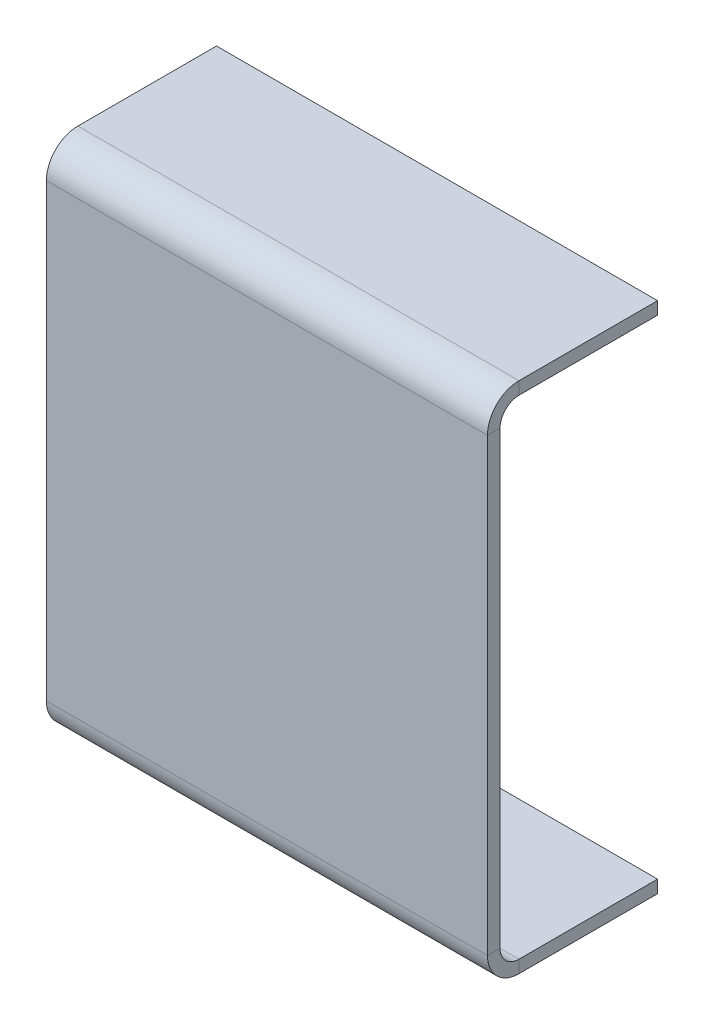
ISO-10303-21;
HEADER;
FILE_DESCRIPTION(('STEP AP214'),'2;1');
FILE_NAME('part.step','',(''),(''),'','','');
FILE_SCHEMA(('AUTOMOTIVE_DESIGN { 1 0 10303 214 1 1 1 1 }'));
ENDSEC;
DATA;
#1=APPLICATION_CONTEXT('core data for automotive mechanical design processes');
#2=APPLICATION_PROTOCOL_DEFINITION('international standard','automotive_design',2000,#1);
#3=PRODUCT_CONTEXT('',#1,'mechanical');
#4=PRODUCT('Part','Part','',(#3));
#5=PRODUCT_RELATED_PRODUCT_CATEGORY('part','',(#4));
#6=PRODUCT_DEFINITION_FORMATION('','',#4);
#7=PRODUCT_DEFINITION_CONTEXT('part definition',#1,'design');
#8=PRODUCT_DEFINITION('design','',#6,#7);
#9=PRODUCT_DEFINITION_SHAPE('','',#8);
#10=(LENGTH_UNIT() NAMED_UNIT(*) SI_UNIT(.MILLI.,.METRE.));
#11=(NAMED_UNIT(*) PLANE_ANGLE_UNIT() SI_UNIT($,.RADIAN.));
#12=(NAMED_UNIT(*) SI_UNIT($,.STERADIAN.) SOLID_ANGLE_UNIT());
#13=UNCERTAINTY_MEASURE_WITH_UNIT(LENGTH_MEASURE(1.E-05),#10,'distance_accuracy_value','');
#14=(GEOMETRIC_REPRESENTATION_CONTEXT(3) GLOBAL_UNCERTAINTY_ASSIGNED_CONTEXT((#13)) GLOBAL_UNIT_ASSIGNED_CONTEXT((#10,
#11,#12)) REPRESENTATION_CONTEXT('',''));
#15=CARTESIAN_POINT('',(0.,0.,0.));
#16=DIRECTION('',(0.,0.,1.));
#17=DIRECTION('',(1.,0.,0.));
#18=AXIS2_PLACEMENT_3D('',#15,#16,#17);
#19=CARTESIAN_POINT('',(70.,71.5,344.989406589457));
#20=DIRECTION('',(1.,0.,0.));
#21=DIRECTION('',(0.,0.,-1.));
#22=AXIS2_PLACEMENT_3D('',#19,#20,#21);
#23=PLANE('',#22);
#24=DIRECTION('',(0.,0.,1.));
#25=VECTOR('',#24,1.);
#26=CARTESIAN_POINT('',(70.,71.5,344.989406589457));
#27=LINE('',#26,#25);
#28=CARTESIAN_POINT('',(70.,71.5,344.989406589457));
#29=VERTEX_POINT('',#28);
#30=CARTESIAN_POINT('',(70.,71.5,348.989406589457));
#31=VERTEX_POINT('',#30);
#32=EDGE_CURVE('E11',#29,#31,#27,.T.);
#33=ORIENTED_EDGE('',*,*,#32,.F.);
#34=CARTESIAN_POINT('',(70.,71.5,338.989406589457));
#35=DIRECTION('',(-1.,0.,0.));
#36=DIRECTION('',(0.,0.,1.));
#37=AXIS2_PLACEMENT_3D('',#34,#35,#36);
#38=CIRCLE('',#37,6.);
#39=CARTESIAN_POINT('',(70.,77.5,338.989406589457));
#40=VERTEX_POINT('',#39);
#41=EDGE_CURVE('E184',#40,#29,#38,.F.);
#42=ORIENTED_EDGE('',*,*,#41,.F.);
#43=DIRECTION('',(0.,-1.,0.));
#44=VECTOR('',#43,1.);
#45=CARTESIAN_POINT('',(70.,81.4999999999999,338.989406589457));
#46=LINE('',#45,#44);
#47=CARTESIAN_POINT('',(70.,81.4999999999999,338.989406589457));
#48=VERTEX_POINT('',#47);
#49=EDGE_CURVE('E37',#48,#40,#46,.T.);
#50=ORIENTED_EDGE('',*,*,#49,.F.);
#51=CARTESIAN_POINT('',(70.,71.5,338.989406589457));
#52=DIRECTION('',(1.,0.,0.));
#53=DIRECTION('',(0.,0.,-1.));
#54=AXIS2_PLACEMENT_3D('',#51,#52,#53);
#55=CIRCLE('',#54,10.);
#56=EDGE_CURVE('E196',#48,#31,#55,.T.);
#57=ORIENTED_EDGE('',*,*,#56,.T.);
#58=EDGE_LOOP('',(#33,#42,#50,#57));
#59=FACE_BOUND('',#58,.T.);
#60=ADVANCED_FACE('F30',(#59),#23,.T.);
#61=CARTESIAN_POINT('',(70.,81.4999999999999,338.989406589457));
#62=DIRECTION('',(1.,0.,0.));
#63=DIRECTION('',(0.,0.,-1.));
#64=AXIS2_PLACEMENT_3D('',#61,#62,#63);
#65=PLANE('',#64);
#66=DIRECTION('',(0.,-1.,0.));
#67=VECTOR('',#66,1.);
#68=CARTESIAN_POINT('',(70.,77.5,344.989406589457));
#69=LINE('',#68,#67);
#70=CARTESIAN_POINT('',(70.,-71.5,344.989406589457));
#71=VERTEX_POINT('',#70);
#72=EDGE_CURVE('E181',#29,#71,#69,.T.);
#73=ORIENTED_EDGE('',*,*,#72,.F.);
#74=ORIENTED_EDGE('',*,*,#32,.T.);
#75=DIRECTION('',(0.,1.,0.));
#76=VECTOR('',#75,1.);
#77=CARTESIAN_POINT('',(70.,77.5,348.989406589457));
#78=LINE('',#77,#76);
#79=CARTESIAN_POINT('',(70.,-71.5,348.989406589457));
#80=VERTEX_POINT('',#79);
#81=EDGE_CURVE('E199',#31,#80,#78,.F.);
#82=ORIENTED_EDGE('',*,*,#81,.T.);
#83=DIRECTION('',(0.,0.,-1.));
#84=VECTOR('',#83,1.);
#85=CARTESIAN_POINT('',(70.,-71.5,348.989406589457));
#86=LINE('',#85,#84);
#87=EDGE_CURVE('E51',#80,#71,#86,.T.);
#88=ORIENTED_EDGE('',*,*,#87,.T.);
#89=EDGE_LOOP('',(#73,#74,#82,#88));
#90=FACE_BOUND('',#89,.T.);
#91=ADVANCED_FACE('F275',(#90),#65,.T.);
#92=CARTESIAN_POINT('',(-70.,77.5,338.989406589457));
#93=DIRECTION('',(-1.,0.,0.));
#94=DIRECTION('',(0.,0.,1.));
#95=AXIS2_PLACEMENT_3D('',#92,#93,#94);
#96=PLANE('',#95);
#97=DIRECTION('',(0.,1.,0.));
#98=VECTOR('',#97,1.);
#99=CARTESIAN_POINT('',(-70.,77.5,338.989406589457));
#100=LINE('',#99,#98);
#101=CARTESIAN_POINT('',(-70.,77.5,338.989406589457));
#102=VERTEX_POINT('',#101);
#103=CARTESIAN_POINT('',(-70.,81.4999999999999,338.989406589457));
#104=VERTEX_POINT('',#103);
#105=EDGE_CURVE('E237',#102,#104,#100,.T.);
#106=ORIENTED_EDGE('',*,*,#105,.F.);
#107=CARTESIAN_POINT('',(-70.,71.5,338.989406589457));
#108=DIRECTION('',(-1.,0.,0.));
#109=DIRECTION('',(0.,0.,1.));
#110=AXIS2_PLACEMENT_3D('',#107,#108,#109);
#111=CIRCLE('',#110,6.);
#112=CARTESIAN_POINT('',(-70.,71.5,344.989406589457));
#113=VERTEX_POINT('',#112);
#114=EDGE_CURVE('E152',#102,#113,#111,.F.);
#115=ORIENTED_EDGE('',*,*,#114,.T.);
#116=DIRECTION('',(0.,0.,-1.));
#117=VECTOR('',#116,1.);
#118=CARTESIAN_POINT('',(-70.,71.5,348.989406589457));
#119=LINE('',#118,#117);
#120=CARTESIAN_POINT('',(-70.,71.5,348.989406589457));
#121=VERTEX_POINT('',#120);
#122=EDGE_CURVE('E235',#121,#113,#119,.T.);
#123=ORIENTED_EDGE('',*,*,#122,.F.);
#124=CARTESIAN_POINT('',(-70.,71.5,338.989406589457));
#125=DIRECTION('',(1.,0.,0.));
#126=DIRECTION('',(0.,0.,-1.));
#127=AXIS2_PLACEMENT_3D('',#124,#125,#126);
#128=CIRCLE('',#127,10.);
#129=EDGE_CURVE('E164',#104,#121,#128,.T.);
#130=ORIENTED_EDGE('',*,*,#129,.F.);
#131=EDGE_LOOP('',(#106,#115,#123,#130));
#132=FACE_BOUND('',#131,.T.);
#133=ADVANCED_FACE('F281',(#132),#96,.T.);
#134=CARTESIAN_POINT('',(-70.,71.5,348.989406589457));
#135=DIRECTION('',(-1.,0.,0.));
#136=DIRECTION('',(0.,0.,1.));
#137=AXIS2_PLACEMENT_3D('',#134,#135,#136);
#138=PLANE('',#137);
#139=DIRECTION('',(0.,0.,1.));
#140=VECTOR('',#139,1.);
#141=CARTESIAN_POINT('',(-70.,77.5,294.989406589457));
#142=LINE('',#141,#140);
#143=CARTESIAN_POINT('',(-70.,77.5,294.989406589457));
#144=VERTEX_POINT('',#143);
#145=EDGE_CURVE('E155',#144,#102,#142,.T.);
#146=ORIENTED_EDGE('',*,*,#145,.T.);
#147=ORIENTED_EDGE('',*,*,#105,.T.);
#148=DIRECTION('',(0.,0.,-1.));
#149=VECTOR('',#148,1.);
#150=CARTESIAN_POINT('',(-70.,81.5,294.989406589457));
#151=LINE('',#150,#149);
#152=CARTESIAN_POINT('',(-70.,81.5,294.989406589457));
#153=VERTEX_POINT('',#152);
#154=EDGE_CURVE('E161',#153,#104,#151,.F.);
#155=ORIENTED_EDGE('',*,*,#154,.F.);
#156=DIRECTION('',(0.,-1.,0.));
#157=VECTOR('',#156,1.);
#158=CARTESIAN_POINT('',(-70.,81.5,294.989406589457));
#159=LINE('',#158,#157);
#160=EDGE_CURVE('E158',#153,#144,#159,.T.);
#161=ORIENTED_EDGE('',*,*,#160,.T.);
#162=EDGE_LOOP('',(#146,#147,#155,#161));
#163=FACE_BOUND('',#162,.T.);
#164=ADVANCED_FACE('F259',(#163),#138,.T.);
#165=CARTESIAN_POINT('',(70.,-77.5,338.989406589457));
#166=DIRECTION('',(1.,0.,0.));
#167=DIRECTION('',(0.,0.,-1.));
#168=AXIS2_PLACEMENT_3D('',#165,#166,#167);
#169=PLANE('',#168);
#170=DIRECTION('',(0.,-1.,0.));
#171=VECTOR('',#170,1.);
#172=CARTESIAN_POINT('',(70.,-77.5,338.989406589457));
#173=LINE('',#172,#171);
#174=CARTESIAN_POINT('',(70.,-77.5,338.989406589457));
#175=VERTEX_POINT('',#174);
#176=CARTESIAN_POINT('',(70.,-81.5,338.989406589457));
#177=VERTEX_POINT('',#176);
#178=EDGE_CURVE('E44',#175,#177,#173,.T.);
#179=ORIENTED_EDGE('',*,*,#178,.F.);
#180=CARTESIAN_POINT('',(70.,-71.5,338.989406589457));
#181=DIRECTION('',(-1.,0.,0.));
#182=DIRECTION('',(0.,0.,1.));
#183=AXIS2_PLACEMENT_3D('',#180,#181,#182);
#184=CIRCLE('',#183,6.);
#185=EDGE_CURVE('E178',#71,#175,#184,.F.);
#186=ORIENTED_EDGE('',*,*,#185,.F.);
#187=ORIENTED_EDGE('',*,*,#87,.F.);
#188=CARTESIAN_POINT('',(70.,-71.5,338.989406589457));
#189=DIRECTION('',(1.,0.,0.));
#190=DIRECTION('',(0.,0.,-1.));
#191=AXIS2_PLACEMENT_3D('',#188,#189,#190);
#192=CIRCLE('',#191,10.);
#193=EDGE_CURVE('E201',#80,#177,#192,.T.);
#194=ORIENTED_EDGE('',*,*,#193,.T.);
#195=EDGE_LOOP('',(#179,#186,#187,#194));
#196=FACE_BOUND('',#195,.T.);
#197=ADVANCED_FACE('F290',(#196),#169,.T.);
#198=CARTESIAN_POINT('',(70.,-71.5,348.989406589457));
#199=DIRECTION('',(1.,0.,0.));
#200=DIRECTION('',(0.,0.,-1.));
#201=AXIS2_PLACEMENT_3D('',#198,#199,#200);
#202=PLANE('',#201);
#203=DIRECTION('',(0.,0.,-1.));
#204=VECTOR('',#203,1.);
#205=CARTESIAN_POINT('',(70.,-77.5,344.989406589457));
#206=LINE('',#205,#204);
#207=CARTESIAN_POINT('',(70.,-77.5,294.989406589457));
#208=VERTEX_POINT('',#207);
#209=EDGE_CURVE('E175',#175,#208,#206,.T.);
#210=ORIENTED_EDGE('',*,*,#209,.F.);
#211=ORIENTED_EDGE('',*,*,#178,.T.);
#212=DIRECTION('',(0.,0.,-1.));
#213=VECTOR('',#212,1.);
#214=CARTESIAN_POINT('',(70.,-81.5,344.989406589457));
#215=LINE('',#214,#213);
#216=CARTESIAN_POINT('',(70.,-81.5,294.989406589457));
#217=VERTEX_POINT('',#216);
#218=EDGE_CURVE('E172',#177,#217,#215,.T.);
#219=ORIENTED_EDGE('',*,*,#218,.T.);
#220=DIRECTION('',(0.,-1.,0.));
#221=VECTOR('',#220,1.);
#222=CARTESIAN_POINT('',(70.,-77.5,294.989406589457));
#223=LINE('',#222,#221);
#224=EDGE_CURVE('E123',#208,#217,#223,.T.);
#225=ORIENTED_EDGE('',*,*,#224,.F.);
#226=EDGE_LOOP('',(#210,#211,#219,#225));
#227=FACE_BOUND('',#226,.T.);
#228=ADVANCED_FACE('F295',(#227),#202,.T.);
#229=CARTESIAN_POINT('',(-70.,-71.5,344.989406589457));
#230=DIRECTION('',(-1.,0.,0.));
#231=DIRECTION('',(0.,0.,1.));
#232=AXIS2_PLACEMENT_3D('',#229,#230,#231);
#233=PLANE('',#232);
#234=DIRECTION('',(0.,0.,1.));
#235=VECTOR('',#234,1.);
#236=CARTESIAN_POINT('',(-70.,-71.5,344.989406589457));
#237=LINE('',#236,#235);
#238=CARTESIAN_POINT('',(-70.,-71.5,344.989406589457));
#239=VERTEX_POINT('',#238);
#240=CARTESIAN_POINT('',(-70.,-71.5,348.989406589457));
#241=VERTEX_POINT('',#240);
#242=EDGE_CURVE('E231',#239,#241,#237,.T.);
#243=ORIENTED_EDGE('',*,*,#242,.F.);
#244=CARTESIAN_POINT('',(-70.,-71.5,338.989406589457));
#245=DIRECTION('',(-1.,0.,0.));
#246=DIRECTION('',(0.,0.,1.));
#247=AXIS2_PLACEMENT_3D('',#244,#245,#246);
#248=CIRCLE('',#247,6.);
#249=CARTESIAN_POINT('',(-70.,-77.5,338.989406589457));
#250=VERTEX_POINT('',#249);
#251=EDGE_CURVE('E146',#239,#250,#248,.F.);
#252=ORIENTED_EDGE('',*,*,#251,.T.);
#253=DIRECTION('',(0.,1.,0.));
#254=VECTOR('',#253,1.);
#255=CARTESIAN_POINT('',(-70.,-81.5,338.989406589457));
#256=LINE('',#255,#254);
#257=CARTESIAN_POINT('',(-70.,-81.5,338.989406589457));
#258=VERTEX_POINT('',#257);
#259=EDGE_CURVE('E127',#258,#250,#256,.T.);
#260=ORIENTED_EDGE('',*,*,#259,.F.);
#261=CARTESIAN_POINT('',(-70.,-71.5,338.989406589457));
#262=DIRECTION('',(1.,0.,0.));
#263=DIRECTION('',(0.,0.,-1.));
#264=AXIS2_PLACEMENT_3D('',#261,#262,#263);
#265=CIRCLE('',#264,10.);
#266=EDGE_CURVE('E170',#241,#258,#265,.T.);
#267=ORIENTED_EDGE('',*,*,#266,.F.);
#268=EDGE_LOOP('',(#243,#252,#260,#267));
#269=FACE_BOUND('',#268,.T.);
#270=ADVANCED_FACE('F287',(#269),#233,.T.);
#271=CARTESIAN_POINT('',(-70.,-81.5,338.989406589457));
#272=DIRECTION('',(-1.,0.,0.));
#273=DIRECTION('',(0.,0.,1.));
#274=AXIS2_PLACEMENT_3D('',#271,#272,#273);
#275=PLANE('',#274);
#276=DIRECTION('',(0.,-1.,0.));
#277=VECTOR('',#276,1.);
#278=CARTESIAN_POINT('',(-70.,77.5,344.989406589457));
#279=LINE('',#278,#277);
#280=EDGE_CURVE('E149',#113,#239,#279,.T.);
#281=ORIENTED_EDGE('',*,*,#280,.T.);
#282=ORIENTED_EDGE('',*,*,#242,.T.);
#283=DIRECTION('',(0.,1.,0.));
#284=VECTOR('',#283,1.);
#285=CARTESIAN_POINT('',(-70.,77.5,348.989406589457));
#286=LINE('',#285,#284);
#287=EDGE_CURVE('E167',#121,#241,#286,.F.);
#288=ORIENTED_EDGE('',*,*,#287,.F.);
#289=ORIENTED_EDGE('',*,*,#122,.T.);
#290=EDGE_LOOP('',(#281,#282,#288,#289));
#291=FACE_BOUND('',#290,.T.);
#292=ADVANCED_FACE('F283',(#291),#275,.T.);
#293=CARTESIAN_POINT('',(70.,-81.5,344.989406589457));
#294=DIRECTION('',(0.,1.,0.));
#295=DIRECTION('',(0.,0.,1.));
#296=AXIS2_PLACEMENT_3D('',#293,#294,#295);
#297=PLANE('',#296);
#298=DIRECTION('',(-1.,0.,0.));
#299=VECTOR('',#298,1.);
#300=CARTESIAN_POINT('',(70.,-81.5,338.989406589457));
#301=LINE('',#300,#299);
#302=EDGE_CURVE('E142',#177,#258,#301,.T.);
#303=ORIENTED_EDGE('',*,*,#302,.T.);
#304=DIRECTION('',(0.,0.,-1.));
#305=VECTOR('',#304,1.);
#306=CARTESIAN_POINT('',(-70.,-81.5,344.989406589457));
#307=LINE('',#306,#305);
#308=CARTESIAN_POINT('',(-70.,-81.5,294.989406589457));
#309=VERTEX_POINT('',#308);
#310=EDGE_CURVE('E134',#258,#309,#307,.T.);
#311=ORIENTED_EDGE('',*,*,#310,.T.);
#312=DIRECTION('',(-1.,0.,0.));
#313=VECTOR('',#312,1.);
#314=CARTESIAN_POINT('',(70.,-81.5,294.989406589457));
#315=LINE('',#314,#313);
#316=EDGE_CURVE('E118',#217,#309,#315,.T.);
#317=ORIENTED_EDGE('',*,*,#316,.F.);
#318=ORIENTED_EDGE('',*,*,#218,.F.);
#319=EDGE_LOOP('',(#303,#311,#317,#318));
#320=FACE_BOUND('',#319,.T.);
#321=ADVANCED_FACE('F140',(#320),#297,.F.);
#322=CARTESIAN_POINT('',(70.,-77.5,294.989406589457));
#323=DIRECTION('',(0.,0.,-1.));
#324=DIRECTION('',(-1.,0.,0.));
#325=AXIS2_PLACEMENT_3D('',#322,#323,#324);
#326=PLANE('',#325);
#327=ORIENTED_EDGE('',*,*,#316,.T.);
#328=DIRECTION('',(0.,-1.,0.));
#329=VECTOR('',#328,1.);
#330=CARTESIAN_POINT('',(-70.,-77.5,294.989406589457));
#331=LINE('',#330,#329);
#332=CARTESIAN_POINT('',(-70.,-77.5,294.989406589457));
#333=VERTEX_POINT('',#332);
#334=EDGE_CURVE('E121',#333,#309,#331,.T.);
#335=ORIENTED_EDGE('',*,*,#334,.F.);
#336=DIRECTION('',(-1.,0.,0.));
#337=VECTOR('',#336,1.);
#338=CARTESIAN_POINT('',(70.,-77.5,294.989406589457));
#339=LINE('',#338,#337);
#340=EDGE_CURVE('E128',#208,#333,#339,.T.);
#341=ORIENTED_EDGE('',*,*,#340,.F.);
#342=ORIENTED_EDGE('',*,*,#224,.T.);
#343=EDGE_LOOP('',(#327,#335,#341,#342));
#344=FACE_BOUND('',#343,.T.);
#345=ADVANCED_FACE('F120',(#344),#326,.T.);
#346=CARTESIAN_POINT('',(70.,-77.5,344.989406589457));
#347=DIRECTION('',(0.,1.,0.));
#348=DIRECTION('',(0.,0.,1.));
#349=AXIS2_PLACEMENT_3D('',#346,#347,#348);
#350=PLANE('',#349);
#351=ORIENTED_EDGE('',*,*,#340,.T.);
#352=DIRECTION('',(0.,0.,-1.));
#353=VECTOR('',#352,1.);
#354=CARTESIAN_POINT('',(-70.,-77.5,344.989406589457));
#355=LINE('',#354,#353);
#356=EDGE_CURVE('E137',#250,#333,#355,.T.);
#357=ORIENTED_EDGE('',*,*,#356,.F.);
#358=DIRECTION('',(-1.,0.,0.));
#359=VECTOR('',#358,1.);
#360=CARTESIAN_POINT('',(70.,-77.5,338.989406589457));
#361=LINE('',#360,#359);
#362=EDGE_CURVE('E226',#175,#250,#361,.T.);
#363=ORIENTED_EDGE('',*,*,#362,.F.);
#364=ORIENTED_EDGE('',*,*,#209,.T.);
#365=EDGE_LOOP('',(#351,#357,#363,#364));
#366=FACE_BOUND('',#365,.T.);
#367=ADVANCED_FACE('F293',(#366),#350,.T.);
#368=CARTESIAN_POINT('',(70.,-71.5,338.989406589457));
#369=DIRECTION('',(-1.,0.,0.));
#370=DIRECTION('',(0.,0.,1.));
#371=AXIS2_PLACEMENT_3D('',#368,#369,#370);
#372=CYLINDRICAL_SURFACE('',#371,6.);
#373=ORIENTED_EDGE('',*,*,#362,.T.);
#374=ORIENTED_EDGE('',*,*,#251,.F.);
#375=DIRECTION('',(-1.,0.,0.));
#376=VECTOR('',#375,1.);
#377=CARTESIAN_POINT('',(70.,-71.5,344.989406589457));
#378=LINE('',#377,#376);
#379=EDGE_CURVE('E223',#71,#239,#378,.T.);
#380=ORIENTED_EDGE('',*,*,#379,.F.);
#381=ORIENTED_EDGE('',*,*,#185,.T.);
#382=EDGE_LOOP('',(#373,#374,#380,#381));
#383=FACE_BOUND('',#382,.T.);
#384=ADVANCED_FACE('F296',(#383),#372,.F.);
#385=CARTESIAN_POINT('',(70.,77.5,344.989406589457));
#386=DIRECTION('',(0.,0.,-1.));
#387=DIRECTION('',(-1.,0.,0.));
#388=AXIS2_PLACEMENT_3D('',#385,#386,#387);
#389=PLANE('',#388);
#390=ORIENTED_EDGE('',*,*,#379,.T.);
#391=ORIENTED_EDGE('',*,*,#280,.F.);
#392=DIRECTION('',(-1.,0.,0.));
#393=VECTOR('',#392,1.);
#394=CARTESIAN_POINT('',(70.,71.5,344.989406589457));
#395=LINE('',#394,#393);
#396=EDGE_CURVE('E220',#29,#113,#395,.T.);
#397=ORIENTED_EDGE('',*,*,#396,.F.);
#398=ORIENTED_EDGE('',*,*,#72,.T.);
#399=EDGE_LOOP('',(#390,#391,#397,#398));
#400=FACE_BOUND('',#399,.T.);
#401=ADVANCED_FACE('F278',(#400),#389,.T.);
#402=CARTESIAN_POINT('',(70.,71.5,338.989406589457));
#403=DIRECTION('',(-1.,0.,0.));
#404=DIRECTION('',(0.,0.,1.));
#405=AXIS2_PLACEMENT_3D('',#402,#403,#404);
#406=CYLINDRICAL_SURFACE('',#405,6.);
#407=ORIENTED_EDGE('',*,*,#396,.T.);
#408=ORIENTED_EDGE('',*,*,#114,.F.);
#409=DIRECTION('',(-1.,0.,0.));
#410=VECTOR('',#409,1.);
#411=CARTESIAN_POINT('',(70.,77.5,338.989406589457));
#412=LINE('',#411,#410);
#413=EDGE_CURVE('E217',#40,#102,#412,.T.);
#414=ORIENTED_EDGE('',*,*,#413,.F.);
#415=ORIENTED_EDGE('',*,*,#41,.T.);
#416=EDGE_LOOP('',(#407,#408,#414,#415));
#417=FACE_BOUND('',#416,.T.);
#418=ADVANCED_FACE('F249',(#417),#406,.F.);
#419=CARTESIAN_POINT('',(70.,77.5,294.989406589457));
#420=DIRECTION('',(0.,-1.,0.));
#421=DIRECTION('',(0.,0.,-1.));
#422=AXIS2_PLACEMENT_3D('',#419,#420,#421);
#423=PLANE('',#422);
#424=ORIENTED_EDGE('',*,*,#413,.T.);
#425=ORIENTED_EDGE('',*,*,#145,.F.);
#426=DIRECTION('',(-1.,0.,0.));
#427=VECTOR('',#426,1.);
#428=CARTESIAN_POINT('',(70.,77.5,294.989406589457));
#429=LINE('',#428,#427);
#430=CARTESIAN_POINT('',(70.,77.5,294.989406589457));
#431=VERTEX_POINT('',#430);
#432=EDGE_CURVE('E215',#431,#144,#429,.T.);
#433=ORIENTED_EDGE('',*,*,#432,.F.);
#434=DIRECTION('',(0.,0.,1.));
#435=VECTOR('',#434,1.);
#436=CARTESIAN_POINT('',(70.,77.5,294.989406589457));
#437=LINE('',#436,#435);
#438=EDGE_CURVE('E187',#431,#40,#437,.T.);
#439=ORIENTED_EDGE('',*,*,#438,.T.);
#440=EDGE_LOOP('',(#424,#425,#433,#439));
#441=FACE_BOUND('',#440,.T.);
#442=ADVANCED_FACE('F253',(#441),#423,.T.);
#443=CARTESIAN_POINT('',(70.,81.5,294.989406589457));
#444=DIRECTION('',(0.,0.,-1.));
#445=DIRECTION('',(-1.,0.,0.));
#446=AXIS2_PLACEMENT_3D('',#443,#444,#445);
#447=PLANE('',#446);
#448=ORIENTED_EDGE('',*,*,#432,.T.);
#449=ORIENTED_EDGE('',*,*,#160,.F.);
#450=DIRECTION('',(-1.,0.,0.));
#451=VECTOR('',#450,1.);
#452=CARTESIAN_POINT('',(70.,81.5,294.989406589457));
#453=LINE('',#452,#451);
#454=CARTESIAN_POINT('',(70.,81.5,294.989406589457));
#455=VERTEX_POINT('',#454);
#456=EDGE_CURVE('E213',#455,#153,#453,.T.);
#457=ORIENTED_EDGE('',*,*,#456,.F.);
#458=DIRECTION('',(0.,-1.,0.));
#459=VECTOR('',#458,1.);
#460=CARTESIAN_POINT('',(70.,81.5,294.989406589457));
#461=LINE('',#460,#459);
#462=EDGE_CURVE('E190',#455,#431,#461,.T.);
#463=ORIENTED_EDGE('',*,*,#462,.T.);
#464=EDGE_LOOP('',(#448,#449,#457,#463));
#465=FACE_BOUND('',#464,.T.);
#466=ADVANCED_FACE('F256',(#465),#447,.T.);
#467=CARTESIAN_POINT('',(70.,81.5,294.989406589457));
#468=DIRECTION('',(0.,-1.,0.));
#469=DIRECTION('',(0.,0.,-1.));
#470=AXIS2_PLACEMENT_3D('',#467,#468,#469);
#471=PLANE('',#470);
#472=ORIENTED_EDGE('',*,*,#456,.T.);
#473=ORIENTED_EDGE('',*,*,#154,.T.);
#474=DIRECTION('',(-1.,0.,0.));
#475=VECTOR('',#474,1.);
#476=CARTESIAN_POINT('',(70.,81.4999999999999,338.989406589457));
#477=LINE('',#476,#475);
#478=EDGE_CURVE('E210',#48,#104,#477,.T.);
#479=ORIENTED_EDGE('',*,*,#478,.F.);
#480=DIRECTION('',(0.,0.,-1.));
#481=VECTOR('',#480,1.);
#482=CARTESIAN_POINT('',(70.,81.5,294.989406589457));
#483=LINE('',#482,#481);
#484=EDGE_CURVE('E193',#455,#48,#483,.F.);
#485=ORIENTED_EDGE('',*,*,#484,.F.);
#486=EDGE_LOOP('',(#472,#473,#479,#485));
#487=FACE_BOUND('',#486,.T.);
#488=ADVANCED_FACE('F261',(#487),#471,.F.);
#489=CARTESIAN_POINT('',(70.,71.5,338.989406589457));
#490=DIRECTION('',(-1.,0.,0.));
#491=DIRECTION('',(0.,0.,1.));
#492=AXIS2_PLACEMENT_3D('',#489,#490,#491);
#493=CYLINDRICAL_SURFACE('',#492,10.);
#494=ORIENTED_EDGE('',*,*,#478,.T.);
#495=ORIENTED_EDGE('',*,*,#129,.T.);
#496=DIRECTION('',(-1.,0.,0.));
#497=VECTOR('',#496,1.);
#498=CARTESIAN_POINT('',(70.,71.5,348.989406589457));
#499=LINE('',#498,#497);
#500=EDGE_CURVE('E207',#31,#121,#499,.T.);
#501=ORIENTED_EDGE('',*,*,#500,.F.);
#502=ORIENTED_EDGE('',*,*,#56,.F.);
#503=EDGE_LOOP('',(#494,#495,#501,#502));
#504=FACE_BOUND('',#503,.T.);
#505=ADVANCED_FACE('F266',(#504),#493,.T.);
#506=CARTESIAN_POINT('',(70.,77.5,348.989406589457));
#507=DIRECTION('',(0.,0.,-1.));
#508=DIRECTION('',(-1.,0.,0.));
#509=AXIS2_PLACEMENT_3D('',#506,#507,#508);
#510=PLANE('',#509);
#511=ORIENTED_EDGE('',*,*,#500,.T.);
#512=ORIENTED_EDGE('',*,*,#287,.T.);
#513=DIRECTION('',(-1.,0.,0.));
#514=VECTOR('',#513,1.);
#515=CARTESIAN_POINT('',(70.,-71.5,348.989406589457));
#516=LINE('',#515,#514);
#517=EDGE_CURVE('E204',#80,#241,#516,.T.);
#518=ORIENTED_EDGE('',*,*,#517,.F.);
#519=ORIENTED_EDGE('',*,*,#81,.F.);
#520=EDGE_LOOP('',(#511,#512,#518,#519));
#521=FACE_BOUND('',#520,.T.);
#522=ADVANCED_FACE('F271',(#521),#510,.F.);
#523=CARTESIAN_POINT('',(70.,-71.5,338.989406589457));
#524=DIRECTION('',(-1.,0.,0.));
#525=DIRECTION('',(0.,0.,1.));
#526=AXIS2_PLACEMENT_3D('',#523,#524,#525);
#527=CYLINDRICAL_SURFACE('',#526,10.);
#528=ORIENTED_EDGE('',*,*,#517,.T.);
#529=ORIENTED_EDGE('',*,*,#266,.T.);
#530=ORIENTED_EDGE('',*,*,#302,.F.);
#531=ORIENTED_EDGE('',*,*,#193,.F.);
#532=EDGE_LOOP('',(#528,#529,#530,#531));
#533=FACE_BOUND('',#532,.T.);
#534=ADVANCED_FACE('F289',(#533),#527,.T.);
#535=CARTESIAN_POINT('',(70.,-71.5,338.989406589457));
#536=DIRECTION('',(-1.,0.,0.));
#537=DIRECTION('',(0.,0.,1.));
#538=AXIS2_PLACEMENT_3D('',#535,#536,#537);
#539=PLANE('',#538);
#540=ORIENTED_EDGE('',*,*,#484,.T.);
#541=ORIENTED_EDGE('',*,*,#49,.T.);
#542=ORIENTED_EDGE('',*,*,#438,.F.);
#543=ORIENTED_EDGE('',*,*,#462,.F.);
#544=EDGE_LOOP('',(#540,#541,#542,#543));
#545=FACE_BOUND('',#544,.T.);
#546=ADVANCED_FACE('F241',(#545),#539,.F.);
#547=CARTESIAN_POINT('',(-70.,-71.5,338.989406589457));
#548=DIRECTION('',(-1.,0.,0.));
#549=DIRECTION('',(0.,0.,1.));
#550=AXIS2_PLACEMENT_3D('',#547,#548,#549);
#551=PLANE('',#550);
#552=ORIENTED_EDGE('',*,*,#310,.F.);
#553=ORIENTED_EDGE('',*,*,#259,.T.);
#554=ORIENTED_EDGE('',*,*,#356,.T.);
#555=ORIENTED_EDGE('',*,*,#334,.T.);
#556=EDGE_LOOP('',(#552,#553,#554,#555));
#557=FACE_BOUND('',#556,.T.);
#558=ADVANCED_FACE('F133',(#557),#551,.T.);
#559=CLOSED_SHELL('',(#60,#91,#133,#164,#197,#228,#270,#292,#321,#345,#367,#384,#401,#418,#442,
#466,#488,#505,#522,#534,#546,#558));
#560=MANIFOLD_SOLID_BREP('B2',#559);
#561=ADVANCED_BREP_SHAPE_REPRESENTATION('',(#18,#560),#14);
#562=SHAPE_DEFINITION_REPRESENTATION(#9,#561);
ENDSEC;
END-ISO-10303-21;
